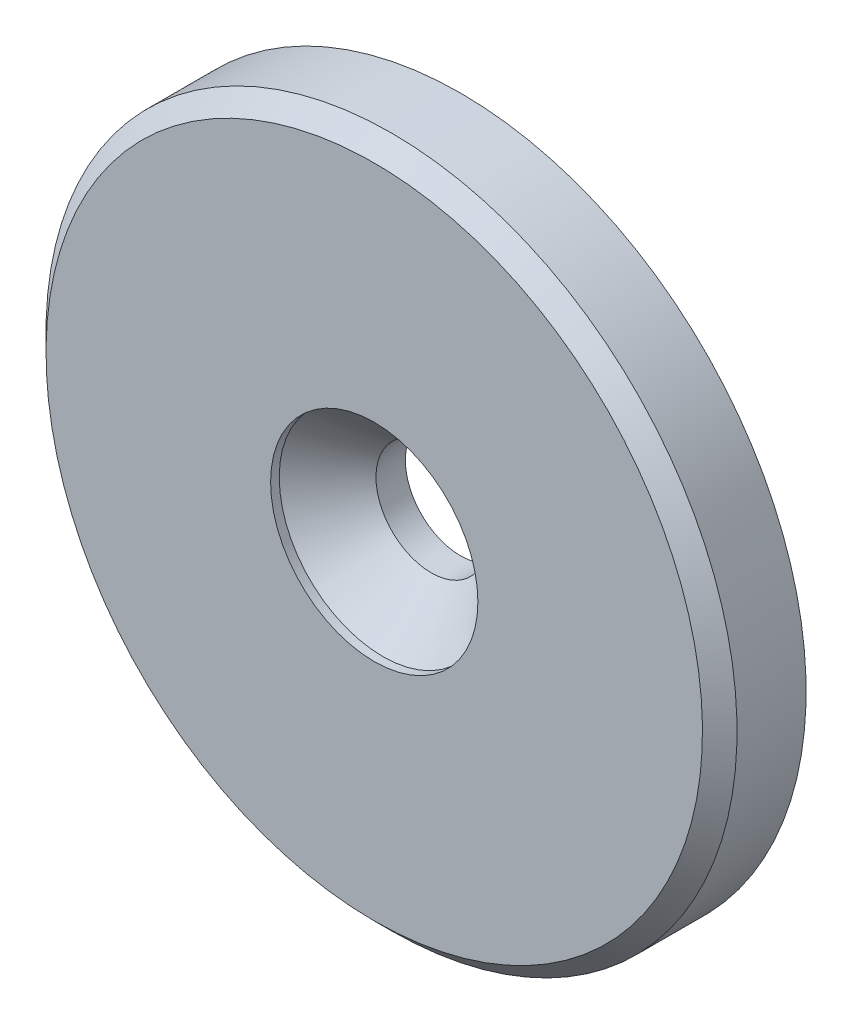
ISO-10303-21;
HEADER;
FILE_DESCRIPTION(('STEP AP214'),'2;1');
FILE_NAME('part.step','',(''),(''),'','','');
FILE_SCHEMA(('AUTOMOTIVE_DESIGN { 1 0 10303 214 1 1 1 1 }'));
ENDSEC;
DATA;
#1=APPLICATION_CONTEXT('core data for automotive mechanical design processes');
#2=APPLICATION_PROTOCOL_DEFINITION('international standard','automotive_design',2000,#1);
#3=PRODUCT_CONTEXT('',#1,'mechanical');
#4=PRODUCT('Part','Part','',(#3));
#5=PRODUCT_RELATED_PRODUCT_CATEGORY('part','',(#4));
#6=PRODUCT_DEFINITION_FORMATION('','',#4);
#7=PRODUCT_DEFINITION_CONTEXT('part definition',#1,'design');
#8=PRODUCT_DEFINITION('design','',#6,#7);
#9=PRODUCT_DEFINITION_SHAPE('','',#8);
#10=(LENGTH_UNIT() NAMED_UNIT(*) SI_UNIT(.MILLI.,.METRE.));
#11=(NAMED_UNIT(*) PLANE_ANGLE_UNIT() SI_UNIT($,.RADIAN.));
#12=(NAMED_UNIT(*) SI_UNIT($,.STERADIAN.) SOLID_ANGLE_UNIT());
#13=UNCERTAINTY_MEASURE_WITH_UNIT(LENGTH_MEASURE(1.E-05),#10,'distance_accuracy_value','');
#14=(GEOMETRIC_REPRESENTATION_CONTEXT(3) GLOBAL_UNCERTAINTY_ASSIGNED_CONTEXT((#13)) GLOBAL_UNIT_ASSIGNED_CONTEXT((#10,
#11,#12)) REPRESENTATION_CONTEXT('',''));
#15=CARTESIAN_POINT('',(0.,0.,0.));
#16=DIRECTION('',(0.,0.,1.));
#17=DIRECTION('',(1.,0.,0.));
#18=AXIS2_PLACEMENT_3D('',#15,#16,#17);
#19=CARTESIAN_POINT('',(0.,0.,1.7));
#20=DIRECTION('',(0.,0.,1.));
#21=DIRECTION('',(0.,-1.,0.));
#22=AXIS2_PLACEMENT_3D('',#19,#20,#21);
#23=CONICAL_SURFACE('',#22,3.2,0.785398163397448);
#24=CARTESIAN_POINT('',(0.,0.,4.5));
#25=DIRECTION('',(0.,0.,1.));
#26=DIRECTION('',(0.,-1.,0.));
#27=AXIS2_PLACEMENT_3D('',#24,#25,#26);
#28=CIRCLE('',#27,6.);
#29=CARTESIAN_POINT('',(0.,-6.,4.5));
#30=VERTEX_POINT('',#29);
#31=EDGE_CURVE('E37',#30,#30,#28,.T.);
#32=ORIENTED_EDGE('',*,*,#31,.T.);
#33=EDGE_LOOP('',(#32));
#34=FACE_BOUND('',#33,.T.);
#35=CARTESIAN_POINT('',(0.,0.,1.7));
#36=DIRECTION('',(0.,0.,1.));
#37=DIRECTION('',(0.,-1.,0.));
#38=AXIS2_PLACEMENT_3D('',#35,#36,#37);
#39=CIRCLE('',#38,3.2);
#40=CARTESIAN_POINT('',(0.,-3.2,1.7));
#41=VERTEX_POINT('',#40);
#42=EDGE_CURVE('E8',#41,#41,#39,.T.);
#43=ORIENTED_EDGE('',*,*,#42,.F.);
#44=EDGE_LOOP('',(#43));
#45=FACE_BOUND('',#44,.T.);
#46=ADVANCED_FACE('F12',(#34,#45),#23,.F.);
#47=CARTESIAN_POINT('',(0.,0.,5.59464274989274));
#48=DIRECTION('',(0.,0.,1.));
#49=DIRECTION('',(0.,-1.,0.));
#50=AXIS2_PLACEMENT_3D('',#47,#48,#49);
#51=CYLINDRICAL_SURFACE('',#50,3.2);
#52=ORIENTED_EDGE('',*,*,#42,.T.);
#53=EDGE_LOOP('',(#52));
#54=FACE_BOUND('',#53,.T.);
#55=CARTESIAN_POINT('',(0.,0.,0.));
#56=DIRECTION('',(0.,0.,1.));
#57=DIRECTION('',(0.,-1.,0.));
#58=AXIS2_PLACEMENT_3D('',#55,#56,#57);
#59=CIRCLE('',#58,3.2);
#60=CARTESIAN_POINT('',(0.,-3.2,0.));
#61=VERTEX_POINT('',#60);
#62=EDGE_CURVE('E18',#61,#61,#59,.T.);
#63=ORIENTED_EDGE('',*,*,#62,.F.);
#64=EDGE_LOOP('',(#63));
#65=FACE_BOUND('',#64,.T.);
#66=ADVANCED_FACE('F57',(#54,#65),#51,.F.);
#67=CARTESIAN_POINT('',(-3.2,0.,0.));
#68=DIRECTION('',(0.,0.,-1.));
#69=DIRECTION('',(0.,1.,0.));
#70=AXIS2_PLACEMENT_3D('',#67,#68,#69);
#71=PLANE('',#70);
#72=ORIENTED_EDGE('',*,*,#62,.T.);
#73=EDGE_LOOP('',(#72));
#74=FACE_BOUND('',#73,.T.);
#75=CARTESIAN_POINT('',(0.,0.,0.));
#76=DIRECTION('',(0.,0.,1.));
#77=DIRECTION('',(0.,-1.,0.));
#78=AXIS2_PLACEMENT_3D('',#75,#76,#77);
#79=CIRCLE('',#78,20.);
#80=CARTESIAN_POINT('',(0.,-20.,0.));
#81=VERTEX_POINT('',#80);
#82=EDGE_CURVE('E22',#81,#81,#79,.T.);
#83=ORIENTED_EDGE('',*,*,#82,.F.);
#84=EDGE_LOOP('',(#83));
#85=FACE_BOUND('',#84,.T.);
#86=ADVANCED_FACE('F62',(#74,#85),#71,.T.);
#87=CARTESIAN_POINT('',(0.,0.,5.59464274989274));
#88=DIRECTION('',(0.,0.,1.));
#89=DIRECTION('',(0.,-1.,0.));
#90=AXIS2_PLACEMENT_3D('',#87,#88,#89);
#91=CYLINDRICAL_SURFACE('',#90,20.);
#92=ORIENTED_EDGE('',*,*,#82,.T.);
#93=EDGE_LOOP('',(#92));
#94=FACE_BOUND('',#93,.T.);
#95=CARTESIAN_POINT('',(0.,0.,4.));
#96=DIRECTION('',(0.,0.,1.));
#97=DIRECTION('',(0.,-1.,0.));
#98=AXIS2_PLACEMENT_3D('',#95,#96,#97);
#99=CIRCLE('',#98,20.);
#100=CARTESIAN_POINT('',(0.,-20.,4.));
#101=VERTEX_POINT('',#100);
#102=EDGE_CURVE('E26',#101,#101,#99,.T.);
#103=ORIENTED_EDGE('',*,*,#102,.F.);
#104=EDGE_LOOP('',(#103));
#105=FACE_BOUND('',#104,.T.);
#106=ADVANCED_FACE('F67',(#94,#105),#91,.T.);
#107=CARTESIAN_POINT('',(0.,0.,5.));
#108=DIRECTION('',(0.,0.,-1.));
#109=DIRECTION('',(0.,1.,0.));
#110=AXIS2_PLACEMENT_3D('',#107,#108,#109);
#111=CONICAL_SURFACE('',#110,19.,0.785398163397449);
#112=ORIENTED_EDGE('',*,*,#102,.T.);
#113=EDGE_LOOP('',(#112));
#114=FACE_BOUND('',#113,.T.);
#115=CARTESIAN_POINT('',(0.,0.,5.));
#116=DIRECTION('',(0.,0.,1.));
#117=DIRECTION('',(0.,-1.,0.));
#118=AXIS2_PLACEMENT_3D('',#115,#116,#117);
#119=CIRCLE('',#118,19.);
#120=CARTESIAN_POINT('',(0.,-19.,5.));
#121=VERTEX_POINT('',#120);
#122=EDGE_CURVE('E31',#121,#121,#119,.T.);
#123=ORIENTED_EDGE('',*,*,#122,.F.);
#124=EDGE_LOOP('',(#123));
#125=FACE_BOUND('',#124,.T.);
#126=ADVANCED_FACE('F53',(#114,#125),#111,.T.);
#127=CARTESIAN_POINT('',(-6.,0.,5.));
#128=DIRECTION('',(0.,0.,1.));
#129=DIRECTION('',(0.,-1.,0.));
#130=AXIS2_PLACEMENT_3D('',#127,#128,#129);
#131=PLANE('',#130);
#132=ORIENTED_EDGE('',*,*,#122,.T.);
#133=EDGE_LOOP('',(#132));
#134=FACE_BOUND('',#133,.T.);
#135=CARTESIAN_POINT('',(0.,0.,5.));
#136=DIRECTION('',(0.,0.,1.));
#137=DIRECTION('',(0.,-1.,0.));
#138=AXIS2_PLACEMENT_3D('',#135,#136,#137);
#139=CIRCLE('',#138,6.);
#140=CARTESIAN_POINT('',(0.,-6.,5.));
#141=VERTEX_POINT('',#140);
#142=EDGE_CURVE('E34',#141,#141,#139,.T.);
#143=ORIENTED_EDGE('',*,*,#142,.F.);
#144=EDGE_LOOP('',(#143));
#145=FACE_BOUND('',#144,.T.);
#146=ADVANCED_FACE('F45',(#134,#145),#131,.T.);
#147=CARTESIAN_POINT('',(0.,0.,5.59464274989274));
#148=DIRECTION('',(0.,0.,1.));
#149=DIRECTION('',(0.,-1.,0.));
#150=AXIS2_PLACEMENT_3D('',#147,#148,#149);
#151=CYLINDRICAL_SURFACE('',#150,6.);
#152=ORIENTED_EDGE('',*,*,#142,.T.);
#153=EDGE_LOOP('',(#152));
#154=FACE_BOUND('',#153,.T.);
#155=ORIENTED_EDGE('',*,*,#31,.F.);
#156=EDGE_LOOP('',(#155));
#157=FACE_BOUND('',#156,.T.);
#158=ADVANCED_FACE('F43',(#154,#157),#151,.F.);
#159=CLOSED_SHELL('',(#46,#66,#86,#106,#126,#146,#158));
#160=MANIFOLD_SOLID_BREP('B1',#159);
#161=ADVANCED_BREP_SHAPE_REPRESENTATION('',(#18,#160),#14);
#162=SHAPE_DEFINITION_REPRESENTATION(#9,#161);
ENDSEC;
END-ISO-10303-21;
